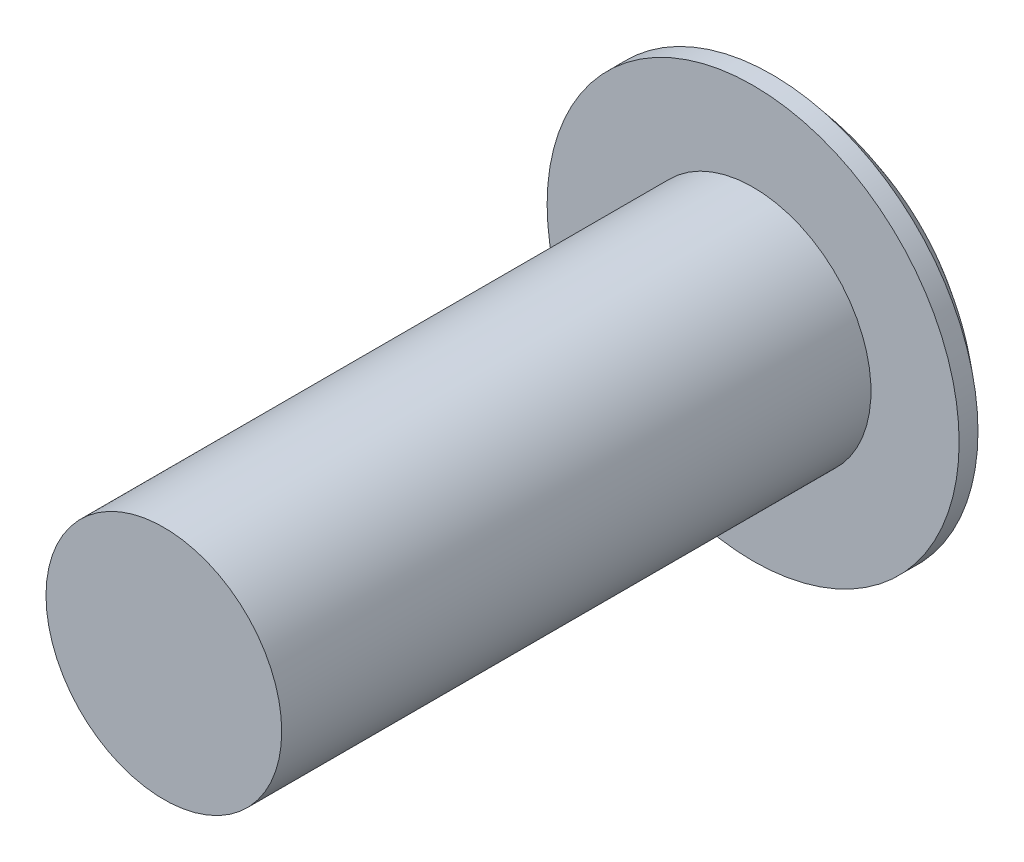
from build123d import *

# Parameters (mm, degrees)
SKETCH2_R      = 3.175
EXTRUDE1_DEPTH = 15.875
EXTRUDE2_DEPTH = 6.35


with BuildPart() as part:
    # Sketch1 → Revolve1 (revolve)
    with BuildSketch(Plane(origin=(0, 0, 0), x_dir=(0, 0, -1), z_dir=(1, 0, 0)), mode=Mode.PRIVATE) as revolve1_sk:
        with BuildLine():
            Line((0, 0), (3.3528, 0))
            ThreePointArc((3.3528, 0), (2.276365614, 2.952287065), (0.508, 5.5499))
            Line((0.508, 5.5499), (0, 5.5499))
            Line((0, 5.5499), (0, 0))
        make_face()
    revolve(revolve1_sk.sketch.rotate(Axis((0, 0, 0), (0, 0, -1)), 90), axis=Axis((0, 0, 0), (0, 0, -1)))

    # Sketch2 → Extrude1 (add)
    with BuildSketch(Plane.XY):
        with Locations(Location((0, 0, 0), (0, 0, 180))):
            Circle(SKETCH2_R)
    extrude(amount=EXTRUDE1_DEPTH)

    # Sketch3 → Extrude2 (cut)
    with BuildSketch(Plane.XY):
        Polygon((-1.083938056, 2.018762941), (-2.290269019, 0.070663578), (-1.206330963, -1.948099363), (1.083938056, -2.018762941), (2.290269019, -0.070663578), (1.206330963, 1.948099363), align=None)
    extrude(amount=-EXTRUDE2_DEPTH, mode=Mode.SUBTRACT)


solid = part.part
